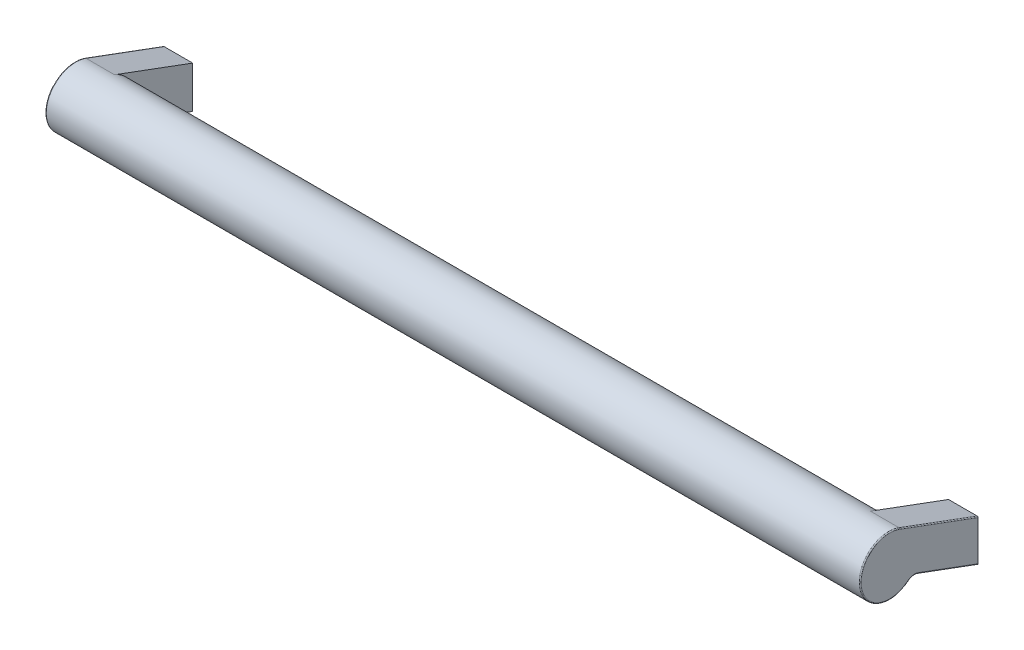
ISO-10303-21;
HEADER;
FILE_DESCRIPTION(('STEP AP214'),'2;1');
FILE_NAME('part.step','',(''),(''),'','','');
FILE_SCHEMA(('AUTOMOTIVE_DESIGN { 1 0 10303 214 1 1 1 1 }'));
ENDSEC;
DATA;
#1=APPLICATION_CONTEXT('core data for automotive mechanical design processes');
#2=APPLICATION_PROTOCOL_DEFINITION('international standard','automotive_design',2000,#1);
#3=PRODUCT_CONTEXT('',#1,'mechanical');
#4=PRODUCT('Part','Part','',(#3));
#5=PRODUCT_RELATED_PRODUCT_CATEGORY('part','',(#4));
#6=PRODUCT_DEFINITION_FORMATION('','',#4);
#7=PRODUCT_DEFINITION_CONTEXT('part definition',#1,'design');
#8=PRODUCT_DEFINITION('design','',#6,#7);
#9=PRODUCT_DEFINITION_SHAPE('','',#8);
#10=(LENGTH_UNIT() NAMED_UNIT(*) SI_UNIT(.MILLI.,.METRE.));
#11=(NAMED_UNIT(*) PLANE_ANGLE_UNIT() SI_UNIT($,.RADIAN.));
#12=(NAMED_UNIT(*) SI_UNIT($,.STERADIAN.) SOLID_ANGLE_UNIT());
#13=UNCERTAINTY_MEASURE_WITH_UNIT(LENGTH_MEASURE(1.E-05),#10,'distance_accuracy_value','');
#14=(GEOMETRIC_REPRESENTATION_CONTEXT(3) GLOBAL_UNCERTAINTY_ASSIGNED_CONTEXT((#13)) GLOBAL_UNIT_ASSIGNED_CONTEXT((#10,
#11,#12)) REPRESENTATION_CONTEXT('',''));
#15=CARTESIAN_POINT('',(0.,0.,0.));
#16=DIRECTION('',(0.,0.,1.));
#17=DIRECTION('',(1.,0.,0.));
#18=AXIS2_PLACEMENT_3D('',#15,#16,#17);
#19=CARTESIAN_POINT('',(142.5,11.,45.));
#20=DIRECTION('',(1.,0.,0.));
#21=DIRECTION('',(0.,1.,0.));
#22=AXIS2_PLACEMENT_3D('',#19,#20,#21);
#23=CYLINDRICAL_SURFACE('',#22,15.);
#24=CARTESIAN_POINT('',(7.5,11.,45.));
#25=DIRECTION('',(1.,0.,0.));
#26=DIRECTION('',(0.,1.,0.));
#27=AXIS2_PLACEMENT_3D('',#24,#25,#26);
#28=CIRCLE('',#27,15.);
#29=CARTESIAN_POINT('',(7.5,-0.545116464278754,35.4234512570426));
#30=VERTEX_POINT('',#29);
#31=CARTESIAN_POINT('',(7.5,25.0660927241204,39.7899102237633));
#32=VERTEX_POINT('',#31);
#33=EDGE_CURVE('E9',#30,#32,#28,.T.);
#34=ORIENTED_EDGE('',*,*,#33,.T.);
#35=DIRECTION('',(1.,0.,0.));
#36=VECTOR('',#35,1.);
#37=CARTESIAN_POINT('',(-7.5,25.0660927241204,39.7899102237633));
#38=LINE('',#37,#36);
#39=CARTESIAN_POINT('',(-7.,25.0660927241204,39.7899102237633));
#40=VERTEX_POINT('',#39);
#41=EDGE_CURVE('E373',#32,#40,#38,.F.);
#42=ORIENTED_EDGE('',*,*,#41,.T.);
#43=CARTESIAN_POINT('',(-7.,11.,45.));
#44=DIRECTION('',(1.,0.,0.));
#45=DIRECTION('',(0.,1.,0.));
#46=AXIS2_PLACEMENT_3D('',#43,#44,#45);
#47=CIRCLE('',#46,15.);
#48=CARTESIAN_POINT('',(-7.,-0.545116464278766,35.4234512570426));
#49=VERTEX_POINT('',#48);
#50=EDGE_CURVE('E354',#49,#40,#47,.F.);
#51=ORIENTED_EDGE('',*,*,#50,.F.);
#52=DIRECTION('',(1.,0.,0.));
#53=VECTOR('',#52,1.);
#54=CARTESIAN_POINT('',(-7.5,-0.545116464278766,35.4234512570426));
#55=LINE('',#54,#53);
#56=EDGE_CURVE('E372',#49,#30,#55,.T.);
#57=ORIENTED_EDGE('',*,*,#56,.T.);
#58=EDGE_LOOP('',(#34,#42,#51,#57));
#59=FACE_BOUND('',#58,.T.);
#60=DIRECTION('',(1.,0.,0.));
#61=VECTOR('',#60,1.);
#62=CARTESIAN_POINT('',(392.5,-0.545116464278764,35.4234512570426));
#63=LINE('',#62,#61);
#64=CARTESIAN_POINT('',(392.5,-0.545116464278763,35.4234512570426));
#65=VERTEX_POINT('',#64);
#66=CARTESIAN_POINT('',(407.,-0.545116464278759,35.4234512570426));
#67=VERTEX_POINT('',#66);
#68=EDGE_CURVE('E139',#65,#67,#63,.T.);
#69=ORIENTED_EDGE('',*,*,#68,.T.);
#70=CARTESIAN_POINT('',(407.,11.,45.));
#71=DIRECTION('',(1.,0.,0.));
#72=DIRECTION('',(0.,1.,0.));
#73=AXIS2_PLACEMENT_3D('',#70,#71,#72);
#74=CIRCLE('',#73,15.);
#75=CARTESIAN_POINT('',(407.,25.0660927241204,39.7899102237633));
#76=VERTEX_POINT('',#75);
#77=EDGE_CURVE('E166',#76,#67,#74,.T.);
#78=ORIENTED_EDGE('',*,*,#77,.F.);
#79=DIRECTION('',(1.,0.,0.));
#80=VECTOR('',#79,1.);
#81=CARTESIAN_POINT('',(392.5,25.0660927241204,39.7899102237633));
#82=LINE('',#81,#80);
#83=CARTESIAN_POINT('',(392.5,25.0660927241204,39.7899102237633));
#84=VERTEX_POINT('',#83);
#85=EDGE_CURVE('E142',#76,#84,#82,.F.);
#86=ORIENTED_EDGE('',*,*,#85,.T.);
#87=CARTESIAN_POINT('',(392.5,11.,45.));
#88=DIRECTION('',(1.,0.,0.));
#89=DIRECTION('',(0.,1.,0.));
#90=AXIS2_PLACEMENT_3D('',#87,#88,#89);
#91=CIRCLE('',#90,15.);
#92=EDGE_CURVE('E136',#65,#84,#91,.T.);
#93=ORIENTED_EDGE('',*,*,#92,.F.);
#94=EDGE_LOOP('',(#69,#78,#86,#93));
#95=FACE_BOUND('',#94,.T.);
#96=ADVANCED_FACE('F14',(#59,#95),#23,.T.);
#97=CARTESIAN_POINT('',(0.,0.,9.));
#98=DIRECTION('',(0.,0.,-1.));
#99=DIRECTION('',(1.,0.,0.));
#100=AXIS2_PLACEMENT_3D('',#97,#98,#99);
#101=PLANE('',#100);
#102=CARTESIAN_POINT('',(0.,0.,9.));
#103=DIRECTION('',(0.,0.,-1.));
#104=DIRECTION('',(1.,0.,0.));
#105=AXIS2_PLACEMENT_3D('',#102,#103,#104);
#106=CIRCLE('',#105,3.);
#107=CARTESIAN_POINT('',(3.,0.,9.));
#108=VERTEX_POINT('',#107);
#109=EDGE_CURVE('E208',#108,#108,#106,.T.);
#110=ORIENTED_EDGE('',*,*,#109,.T.);
#111=EDGE_LOOP('',(#110));
#112=FACE_BOUND('',#111,.T.);
#113=ADVANCED_FACE('F431',(#112),#101,.T.);
#114=CARTESIAN_POINT('',(-7.5,-4.39348861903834,32.2312683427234));
#115=DIRECTION('',(1.,0.,0.));
#116=DIRECTION('',(0.,1.,0.));
#117=AXIS2_PLACEMENT_3D('',#114,#115,#116);
#118=PLANE('',#117);
#119=CARTESIAN_POINT('',(-7.5,11.,45.));
#120=DIRECTION('',(1.,0.,0.));
#121=DIRECTION('',(0.,1.,0.));
#122=AXIS2_PLACEMENT_3D('',#119,#120,#121);
#123=CIRCLE('',#122,14.5);
#124=CARTESIAN_POINT('',(-7.5,25.5,45.));
#125=VERTEX_POINT('',#124);
#126=CARTESIAN_POINT('',(-7.5,-3.5,45.));
#127=VERTEX_POINT('',#126);
#128=EDGE_CURVE('E314',#125,#127,#123,.T.);
#129=ORIENTED_EDGE('',*,*,#128,.F.);
#130=CARTESIAN_POINT('',(-7.5,11.,45.));
#131=DIRECTION('',(1.,0.,0.));
#132=DIRECTION('',(0.,0.937739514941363,-0.347339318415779));
#133=AXIS2_PLACEMENT_3D('',#130,#131,#132);
#134=CIRCLE('',#133,14.5);
#135=CARTESIAN_POINT('',(-7.5,24.5972229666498,39.9635798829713));
#136=VERTEX_POINT('',#135);
#137=EDGE_CURVE('E302',#136,#125,#134,.T.);
#138=ORIENTED_EDGE('',*,*,#137,.F.);
#139=DIRECTION('',(0.,0.347339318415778,0.937739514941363));
#140=VECTOR('',#139,1.);
#141=CARTESIAN_POINT('',(-7.5,9.79468731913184,0.));
#142=LINE('',#141,#140);
#143=CARTESIAN_POINT('',(-7.5,9.79468731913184,0.));
#144=VERTEX_POINT('',#143);
#145=EDGE_CURVE('E328',#144,#136,#142,.T.);
#146=ORIENTED_EDGE('',*,*,#145,.F.);
#147=DIRECTION('',(0.,1.,0.));
#148=VECTOR('',#147,1.);
#149=CARTESIAN_POINT('',(-7.5,-4.39348861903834,0.));
#150=LINE('',#149,#148);
#151=CARTESIAN_POINT('',(-7.5,-10.466802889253,0.));
#152=VERTEX_POINT('',#151);
#153=EDGE_CURVE('E335',#152,#144,#150,.T.);
#154=ORIENTED_EDGE('',*,*,#153,.F.);
#155=DIRECTION('',(0.,-0.347339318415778,-0.937739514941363));
#156=VECTOR('',#155,1.);
#157=CARTESIAN_POINT('',(-7.5,0.764078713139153,30.3209020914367));
#158=LINE('',#157,#156);
#159=CARTESIAN_POINT('',(-7.5,0.764078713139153,30.3209020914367));
#160=VERTEX_POINT('',#159);
#161=EDGE_CURVE('E338',#160,#152,#158,.T.);
#162=ORIENTED_EDGE('',*,*,#161,.F.);
#163=CARTESIAN_POINT('',(-7.5,-4.39348861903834,32.2312683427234));
#164=DIRECTION('',(-1.,0.,0.));
#165=DIRECTION('',(0.,1.,0.));
#166=AXIS2_PLACEMENT_3D('',#163,#164,#165);
#167=CIRCLE('',#166,5.5);
#168=CARTESIAN_POINT('',(-7.5,1.10651138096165,32.2312683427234));
#169=VERTEX_POINT('',#168);
#170=EDGE_CURVE('E290',#169,#160,#167,.T.);
#171=ORIENTED_EDGE('',*,*,#170,.F.);
#172=CARTESIAN_POINT('',(-7.5,-4.39348861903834,32.2312683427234));
#173=DIRECTION('',(-1.,0.,0.));
#174=DIRECTION('',(0.,0.769674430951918,0.638436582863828));
#175=AXIS2_PLACEMENT_3D('',#172,#173,#174);
#176=CIRCLE('',#175,5.5);
#177=CARTESIAN_POINT('',(-7.5,-0.160279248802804,35.7426695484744));
#178=VERTEX_POINT('',#177);
#179=EDGE_CURVE('E249',#178,#169,#176,.T.);
#180=ORIENTED_EDGE('',*,*,#179,.F.);
#181=CARTESIAN_POINT('',(-7.5,11.,45.));
#182=DIRECTION('',(1.,0.,0.));
#183=DIRECTION('',(0.,-1.,0.));
#184=AXIS2_PLACEMENT_3D('',#181,#182,#183);
#185=CIRCLE('',#184,14.5);
#186=EDGE_CURVE('E21',#127,#178,#185,.T.);
#187=ORIENTED_EDGE('',*,*,#186,.F.);
#188=EDGE_LOOP('',(#129,#138,#146,#154,#162,#171,#180,#187));
#189=FACE_BOUND('',#188,.T.);
#190=ADVANCED_FACE('F268',(#189),#118,.F.);
#191=CARTESIAN_POINT('',(0.,0.,9.));
#192=DIRECTION('',(0.,0.,-1.));
#193=DIRECTION('',(1.,0.,0.));
#194=AXIS2_PLACEMENT_3D('',#191,#192,#193);
#195=CYLINDRICAL_SURFACE('',#194,3.);
#196=ORIENTED_EDGE('',*,*,#109,.F.);
#197=EDGE_LOOP('',(#196));
#198=FACE_BOUND('',#197,.T.);
#199=CARTESIAN_POINT('',(0.,0.,0.));
#200=DIRECTION('',(0.,0.,-1.));
#201=DIRECTION('',(1.,0.,0.));
#202=AXIS2_PLACEMENT_3D('',#199,#200,#201);
#203=CIRCLE('',#202,3.);
#204=CARTESIAN_POINT('',(3.,0.,0.));
#205=VERTEX_POINT('',#204);
#206=EDGE_CURVE('E205',#205,#205,#203,.T.);
#207=ORIENTED_EDGE('',*,*,#206,.T.);
#208=EDGE_LOOP('',(#207));
#209=FACE_BOUND('',#208,.T.);
#210=ADVANCED_FACE('F435',(#198,#209),#195,.F.);
#211=CARTESIAN_POINT('',(-7.,0.764078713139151,30.3209020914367));
#212=DIRECTION('',(0.,0.347339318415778,0.937739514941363));
#213=DIRECTION('',(0.,0.937739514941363,-0.347339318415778));
#214=AXIS2_PLACEMENT_3D('',#211,#212,#213);
#215=CYLINDRICAL_SURFACE('',#214,0.5);
#216=CARTESIAN_POINT('',(-7.,0.764078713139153,30.3209020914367));
#217=DIRECTION('',(0.,0.347339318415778,0.937739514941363));
#218=DIRECTION('',(0.,0.937739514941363,-0.347339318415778));
#219=AXIS2_PLACEMENT_3D('',#216,#217,#218);
#220=CIRCLE('',#219,0.5);
#221=CARTESIAN_POINT('',(-7.,0.29520895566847,30.4945717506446));
#222=VERTEX_POINT('',#221);
#223=EDGE_CURVE('E364',#222,#160,#220,.F.);
#224=ORIENTED_EDGE('',*,*,#223,.T.);
#225=ORIENTED_EDGE('',*,*,#161,.T.);
#226=CARTESIAN_POINT('',(-7.,-10.466802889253,0.));
#227=DIRECTION('',(0.,0.,1.));
#228=DIRECTION('',(0.,1.,0.));
#229=AXIS2_PLACEMENT_3D('',#226,#227,#228);
#230=ELLIPSE('',#229,0.53319711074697,0.5);
#231=CARTESIAN_POINT('',(-7.,-11.,0.));
#232=VERTEX_POINT('',#231);
#233=EDGE_CURVE('E366',#152,#232,#230,.T.);
#234=ORIENTED_EDGE('',*,*,#233,.T.);
#235=DIRECTION('',(0.,0.347339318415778,0.937739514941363));
#236=VECTOR('',#235,1.);
#237=CARTESIAN_POINT('',(-7.,0.295208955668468,30.4945717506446));
#238=LINE('',#237,#236);
#239=EDGE_CURVE('E217',#232,#222,#238,.T.);
#240=ORIENTED_EDGE('',*,*,#239,.T.);
#241=EDGE_LOOP('',(#224,#225,#234,#240));
#242=FACE_BOUND('',#241,.T.);
#243=ADVANCED_FACE('F226',(#242),#215,.T.);
#244=CARTESIAN_POINT('',(-7.,-4.39348861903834,32.2312683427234));
#245=DIRECTION('',(1.,0.,0.));
#246=DIRECTION('',(0.,1.,0.));
#247=AXIS2_PLACEMENT_3D('',#244,#245,#246);
#248=TOROIDAL_SURFACE('',#247,5.49999999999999,0.5);
#249=ORIENTED_EDGE('',*,*,#170,.T.);
#250=ORIENTED_EDGE('',*,*,#223,.F.);
#251=CARTESIAN_POINT('',(-7.,-4.39348861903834,32.2312683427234));
#252=DIRECTION('',(1.,0.,0.));
#253=DIRECTION('',(0.,1.,0.));
#254=AXIS2_PLACEMENT_3D('',#251,#252,#253);
#255=CIRCLE('',#254,5.);
#256=EDGE_CURVE('E382',#222,#49,#255,.T.);
#257=ORIENTED_EDGE('',*,*,#256,.T.);
#258=CARTESIAN_POINT('',(-7.,-0.160279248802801,35.7426695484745));
#259=DIRECTION('',(0.,0.638436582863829,-0.769674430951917));
#260=DIRECTION('',(0.,-0.769674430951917,-0.638436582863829));
#261=AXIS2_PLACEMENT_3D('',#258,#259,#260);
#262=CIRCLE('',#261,0.5);
#263=EDGE_CURVE('E347',#178,#49,#262,.F.);
#264=ORIENTED_EDGE('',*,*,#263,.F.);
#265=ORIENTED_EDGE('',*,*,#179,.T.);
#266=EDGE_LOOP('',(#249,#250,#257,#264,#265));
#267=FACE_BOUND('',#266,.T.);
#268=ADVANCED_FACE('F220',(#267),#248,.T.);
#269=CARTESIAN_POINT('',(-7.,18.5811294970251,23.7214550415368));
#270=DIRECTION('',(0.,-0.347339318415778,-0.937739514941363));
#271=DIRECTION('',(0.,-0.937739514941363,0.347339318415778));
#272=AXIS2_PLACEMENT_3D('',#269,#270,#271);
#273=CYLINDRICAL_SURFACE('',#272,0.5);
#274=CARTESIAN_POINT('',(-7.,9.79468731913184,0.));
#275=DIRECTION('',(0.,0.,1.));
#276=DIRECTION('',(0.,-1.,0.));
#277=AXIS2_PLACEMENT_3D('',#274,#275,#276);
#278=ELLIPSE('',#277,0.533197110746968,0.5);
#279=CARTESIAN_POINT('',(-7.,10.3278844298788,0.));
#280=VERTEX_POINT('',#279);
#281=EDGE_CURVE('E359',#280,#144,#278,.T.);
#282=ORIENTED_EDGE('',*,*,#281,.T.);
#283=ORIENTED_EDGE('',*,*,#145,.T.);
#284=CARTESIAN_POINT('',(-7.,24.5972229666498,39.9635798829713));
#285=DIRECTION('',(0.,0.347339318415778,0.937739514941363));
#286=DIRECTION('',(0.,0.937739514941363,-0.347339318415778));
#287=AXIS2_PLACEMENT_3D('',#284,#285,#286);
#288=CIRCLE('',#287,0.5);
#289=EDGE_CURVE('E355',#40,#136,#288,.T.);
#290=ORIENTED_EDGE('',*,*,#289,.F.);
#291=DIRECTION('',(0.,-0.347339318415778,-0.937739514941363));
#292=VECTOR('',#291,1.);
#293=CARTESIAN_POINT('',(-7.,19.0499992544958,23.547785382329));
#294=LINE('',#293,#292);
#295=EDGE_CURVE('E276',#40,#280,#294,.T.);
#296=ORIENTED_EDGE('',*,*,#295,.T.);
#297=EDGE_LOOP('',(#282,#283,#290,#296));
#298=FACE_BOUND('',#297,.T.);
#299=ADVANCED_FACE('F225',(#298),#273,.T.);
#300=CARTESIAN_POINT('',(-7.,11.,45.));
#301=DIRECTION('',(1.,0.,0.));
#302=DIRECTION('',(0.,1.,0.));
#303=AXIS2_PLACEMENT_3D('',#300,#301,#302);
#304=TOROIDAL_SURFACE('',#303,14.5,0.5);
#305=ORIENTED_EDGE('',*,*,#263,.T.);
#306=ORIENTED_EDGE('',*,*,#50,.T.);
#307=ORIENTED_EDGE('',*,*,#289,.T.);
#308=ORIENTED_EDGE('',*,*,#137,.T.);
#309=ORIENTED_EDGE('',*,*,#128,.T.);
#310=ORIENTED_EDGE('',*,*,#186,.T.);
#311=EDGE_LOOP('',(#305,#306,#307,#308,#309,#310));
#312=FACE_BOUND('',#311,.T.);
#313=ADVANCED_FACE('F256',(#312),#304,.T.);
#314=CARTESIAN_POINT('',(-7.5,10.3278844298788,0.));
#315=DIRECTION('',(0.,0.,1.));
#316=DIRECTION('',(-1.,0.,0.));
#317=AXIS2_PLACEMENT_3D('',#314,#315,#316);
#318=PLANE('',#317);
#319=ORIENTED_EDGE('',*,*,#206,.F.);
#320=EDGE_LOOP('',(#319));
#321=FACE_BOUND('',#320,.T.);
#322=ORIENTED_EDGE('',*,*,#281,.F.);
#323=DIRECTION('',(-1.,0.,0.));
#324=VECTOR('',#323,1.);
#325=CARTESIAN_POINT('',(-7.5,10.3278844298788,0.));
#326=LINE('',#325,#324);
#327=CARTESIAN_POINT('',(7.5,10.3278844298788,0.));
#328=VERTEX_POINT('',#327);
#329=EDGE_CURVE('E380',#328,#280,#326,.T.);
#330=ORIENTED_EDGE('',*,*,#329,.F.);
#331=DIRECTION('',(0.,-1.,0.));
#332=VECTOR('',#331,1.);
#333=CARTESIAN_POINT('',(7.5,10.3278844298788,0.));
#334=LINE('',#333,#332);
#335=CARTESIAN_POINT('',(7.5,-11.,0.));
#336=VERTEX_POINT('',#335);
#337=EDGE_CURVE('E377',#336,#328,#334,.F.);
#338=ORIENTED_EDGE('',*,*,#337,.F.);
#339=DIRECTION('',(-1.,0.,0.));
#340=VECTOR('',#339,1.);
#341=CARTESIAN_POINT('',(-7.5,-11.,0.));
#342=LINE('',#341,#340);
#343=EDGE_CURVE('E381',#232,#336,#342,.F.);
#344=ORIENTED_EDGE('',*,*,#343,.F.);
#345=ORIENTED_EDGE('',*,*,#233,.F.);
#346=ORIENTED_EDGE('',*,*,#153,.T.);
#347=EDGE_LOOP('',(#322,#330,#338,#344,#345,#346));
#348=FACE_BOUND('',#347,.T.);
#349=ADVANCED_FACE('F266',(#321,#348),#318,.F.);
#350=CARTESIAN_POINT('',(-7.5,-11.,0.));
#351=DIRECTION('',(0.,0.937739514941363,-0.347339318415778));
#352=DIRECTION('',(0.,-0.347339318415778,-0.937739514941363));
#353=AXIS2_PLACEMENT_3D('',#350,#351,#352);
#354=PLANE('',#353);
#355=ORIENTED_EDGE('',*,*,#239,.F.);
#356=ORIENTED_EDGE('',*,*,#343,.T.);
#357=DIRECTION('',(0.,-0.347339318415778,-0.937739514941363));
#358=VECTOR('',#357,1.);
#359=CARTESIAN_POINT('',(7.5,0.29520895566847,30.4945717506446));
#360=LINE('',#359,#358);
#361=CARTESIAN_POINT('',(7.5,0.29520895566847,30.4945717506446));
#362=VERTEX_POINT('',#361);
#363=EDGE_CURVE('E212',#362,#336,#360,.T.);
#364=ORIENTED_EDGE('',*,*,#363,.F.);
#365=DIRECTION('',(-1.,0.,0.));
#366=VECTOR('',#365,1.);
#367=CARTESIAN_POINT('',(-7.5,0.29520895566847,30.4945717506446));
#368=LINE('',#367,#366);
#369=EDGE_CURVE('E211',#222,#362,#368,.F.);
#370=ORIENTED_EDGE('',*,*,#369,.F.);
#371=EDGE_LOOP('',(#355,#356,#364,#370));
#372=FACE_BOUND('',#371,.T.);
#373=ADVANCED_FACE('F417',(#372),#354,.F.);
#374=CARTESIAN_POINT('',(-7.5,-4.39348861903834,32.2312683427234));
#375=DIRECTION('',(1.,0.,0.));
#376=DIRECTION('',(0.,1.,0.));
#377=AXIS2_PLACEMENT_3D('',#374,#375,#376);
#378=CYLINDRICAL_SURFACE('',#377,5.);
#379=ORIENTED_EDGE('',*,*,#256,.F.);
#380=ORIENTED_EDGE('',*,*,#369,.T.);
#381=CARTESIAN_POINT('',(7.5,-4.39348861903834,32.2312683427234));
#382=DIRECTION('',(1.,0.,0.));
#383=DIRECTION('',(0.,1.,0.));
#384=AXIS2_PLACEMENT_3D('',#381,#382,#383);
#385=CIRCLE('',#384,5.);
#386=EDGE_CURVE('E214',#30,#362,#385,.F.);
#387=ORIENTED_EDGE('',*,*,#386,.F.);
#388=ORIENTED_EDGE('',*,*,#56,.F.);
#389=EDGE_LOOP('',(#379,#380,#387,#388));
#390=FACE_BOUND('',#389,.T.);
#391=ADVANCED_FACE('F414',(#390),#378,.F.);
#392=CARTESIAN_POINT('',(-7.5,10.3278844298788,0.));
#393=DIRECTION('',(0.,-0.937739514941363,0.347339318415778));
#394=DIRECTION('',(0.,0.347339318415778,0.937739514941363));
#395=AXIS2_PLACEMENT_3D('',#392,#393,#394);
#396=PLANE('',#395);
#397=ORIENTED_EDGE('',*,*,#295,.F.);
#398=ORIENTED_EDGE('',*,*,#41,.F.);
#399=DIRECTION('',(0.,0.347339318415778,0.937739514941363));
#400=VECTOR('',#399,1.);
#401=CARTESIAN_POINT('',(7.5,10.3278844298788,0.));
#402=LINE('',#401,#400);
#403=EDGE_CURVE('E375',#328,#32,#402,.T.);
#404=ORIENTED_EDGE('',*,*,#403,.F.);
#405=ORIENTED_EDGE('',*,*,#329,.T.);
#406=EDGE_LOOP('',(#397,#398,#404,#405));
#407=FACE_BOUND('',#406,.T.);
#408=ADVANCED_FACE('F228',(#407),#396,.F.);
#409=CARTESIAN_POINT('',(7.5,-4.39348861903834,32.2312683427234));
#410=DIRECTION('',(1.,0.,0.));
#411=DIRECTION('',(0.,1.,0.));
#412=AXIS2_PLACEMENT_3D('',#409,#410,#411);
#413=PLANE('',#412);
#414=ORIENTED_EDGE('',*,*,#403,.T.);
#415=ORIENTED_EDGE('',*,*,#33,.F.);
#416=ORIENTED_EDGE('',*,*,#386,.T.);
#417=ORIENTED_EDGE('',*,*,#363,.T.);
#418=ORIENTED_EDGE('',*,*,#337,.T.);
#419=EDGE_LOOP('',(#414,#415,#416,#417,#418));
#420=FACE_BOUND('',#419,.T.);
#421=ADVANCED_FACE('F418',(#420),#413,.T.);
#422=CARTESIAN_POINT('',(400.,0.,9.));
#423=DIRECTION('',(0.,0.,-1.));
#424=DIRECTION('',(1.,0.,0.));
#425=AXIS2_PLACEMENT_3D('',#422,#423,#424);
#426=PLANE('',#425);
#427=CARTESIAN_POINT('',(400.,0.,9.));
#428=DIRECTION('',(0.,0.,-1.));
#429=DIRECTION('',(1.,0.,0.));
#430=AXIS2_PLACEMENT_3D('',#427,#428,#429);
#431=CIRCLE('',#430,3.);
#432=CARTESIAN_POINT('',(403.,0.,9.));
#433=VERTEX_POINT('',#432);
#434=EDGE_CURVE('E154',#433,#433,#431,.T.);
#435=ORIENTED_EDGE('',*,*,#434,.T.);
#436=EDGE_LOOP('',(#435));
#437=FACE_BOUND('',#436,.T.);
#438=ADVANCED_FACE('F420',(#437),#426,.T.);
#439=CARTESIAN_POINT('',(400.,0.,9.));
#440=DIRECTION('',(0.,0.,-1.));
#441=DIRECTION('',(1.,0.,0.));
#442=AXIS2_PLACEMENT_3D('',#439,#440,#441);
#443=CYLINDRICAL_SURFACE('',#442,3.);
#444=ORIENTED_EDGE('',*,*,#434,.F.);
#445=EDGE_LOOP('',(#444));
#446=FACE_BOUND('',#445,.T.);
#447=CARTESIAN_POINT('',(400.,0.,0.));
#448=DIRECTION('',(0.,0.,-1.));
#449=DIRECTION('',(1.,0.,0.));
#450=AXIS2_PLACEMENT_3D('',#447,#448,#449);
#451=CIRCLE('',#450,3.);
#452=CARTESIAN_POINT('',(403.,0.,0.));
#453=VERTEX_POINT('',#452);
#454=EDGE_CURVE('E202',#453,#453,#451,.T.);
#455=ORIENTED_EDGE('',*,*,#454,.T.);
#456=EDGE_LOOP('',(#455));
#457=FACE_BOUND('',#456,.T.);
#458=ADVANCED_FACE('F426',(#446,#457),#443,.F.);
#459=CARTESIAN_POINT('',(407.,-10.5311302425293,-0.173669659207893));
#460=DIRECTION('',(0.,-0.347339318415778,-0.937739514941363));
#461=DIRECTION('',(0.,-0.937739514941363,0.347339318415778));
#462=AXIS2_PLACEMENT_3D('',#459,#460,#461);
#463=CYLINDRICAL_SURFACE('',#462,0.5);
#464=CARTESIAN_POINT('',(407.,0.764078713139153,30.3209020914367));
#465=DIRECTION('',(0.,-0.347339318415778,-0.937739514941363));
#466=DIRECTION('',(0.,-0.937739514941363,0.347339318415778));
#467=AXIS2_PLACEMENT_3D('',#464,#465,#466);
#468=CIRCLE('',#467,0.5);
#469=CARTESIAN_POINT('',(407.5,0.764078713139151,30.3209020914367));
#470=VERTEX_POINT('',#469);
#471=CARTESIAN_POINT('',(407.,0.29520895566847,30.4945717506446));
#472=VERTEX_POINT('',#471);
#473=EDGE_CURVE('E162',#470,#472,#468,.T.);
#474=ORIENTED_EDGE('',*,*,#473,.T.);
#475=DIRECTION('',(0.,-0.347339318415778,-0.937739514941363));
#476=VECTOR('',#475,1.);
#477=CARTESIAN_POINT('',(407.,-11.,0.));
#478=LINE('',#477,#476);
#479=CARTESIAN_POINT('',(407.,-11.,0.));
#480=VERTEX_POINT('',#479);
#481=EDGE_CURVE('E198',#472,#480,#478,.T.);
#482=ORIENTED_EDGE('',*,*,#481,.T.);
#483=CARTESIAN_POINT('',(407.,-10.466802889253,0.));
#484=DIRECTION('',(0.,0.,1.));
#485=DIRECTION('',(0.,-1.,0.));
#486=AXIS2_PLACEMENT_3D('',#483,#484,#485);
#487=ELLIPSE('',#486,0.53319711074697,0.5);
#488=CARTESIAN_POINT('',(407.5,-10.466802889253,0.));
#489=VERTEX_POINT('',#488);
#490=EDGE_CURVE('E594',#480,#489,#487,.T.);
#491=ORIENTED_EDGE('',*,*,#490,.T.);
#492=DIRECTION('',(0.,-0.347339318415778,-0.937739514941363));
#493=VECTOR('',#492,1.);
#494=CARTESIAN_POINT('',(407.5,0.764078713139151,30.3209020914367));
#495=LINE('',#494,#493);
#496=EDGE_CURVE('E617',#470,#489,#495,.T.);
#497=ORIENTED_EDGE('',*,*,#496,.F.);
#498=EDGE_LOOP('',(#474,#482,#491,#497));
#499=FACE_BOUND('',#498,.T.);
#500=ADVANCED_FACE('F190',(#499),#463,.T.);
#501=CARTESIAN_POINT('',(392.5,10.3278844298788,0.));
#502=DIRECTION('',(0.,0.,1.));
#503=DIRECTION('',(-1.,0.,0.));
#504=AXIS2_PLACEMENT_3D('',#501,#502,#503);
#505=PLANE('',#504);
#506=ORIENTED_EDGE('',*,*,#454,.F.);
#507=EDGE_LOOP('',(#506));
#508=FACE_BOUND('',#507,.T.);
#509=ORIENTED_EDGE('',*,*,#490,.F.);
#510=DIRECTION('',(-1.,0.,0.));
#511=VECTOR('',#510,1.);
#512=CARTESIAN_POINT('',(392.5,-11.,0.));
#513=LINE('',#512,#511);
#514=CARTESIAN_POINT('',(392.5,-11.,0.));
#515=VERTEX_POINT('',#514);
#516=EDGE_CURVE('E593',#515,#480,#513,.F.);
#517=ORIENTED_EDGE('',*,*,#516,.F.);
#518=DIRECTION('',(0.,-1.,0.));
#519=VECTOR('',#518,1.);
#520=CARTESIAN_POINT('',(392.5,10.3278844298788,0.));
#521=LINE('',#520,#519);
#522=CARTESIAN_POINT('',(392.5,10.3278844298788,0.));
#523=VERTEX_POINT('',#522);
#524=EDGE_CURVE('E592',#523,#515,#521,.T.);
#525=ORIENTED_EDGE('',*,*,#524,.F.);
#526=DIRECTION('',(-1.,0.,0.));
#527=VECTOR('',#526,1.);
#528=CARTESIAN_POINT('',(392.5,10.3278844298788,0.));
#529=LINE('',#528,#527);
#530=CARTESIAN_POINT('',(407.,10.3278844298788,0.));
#531=VERTEX_POINT('',#530);
#532=EDGE_CURVE('E590',#531,#523,#529,.T.);
#533=ORIENTED_EDGE('',*,*,#532,.F.);
#534=CARTESIAN_POINT('',(407.,9.79468731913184,0.));
#535=DIRECTION('',(0.,0.,1.));
#536=DIRECTION('',(0.,1.,0.));
#537=AXIS2_PLACEMENT_3D('',#534,#535,#536);
#538=ELLIPSE('',#537,0.533197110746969,0.5);
#539=CARTESIAN_POINT('',(407.5,9.79468731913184,0.));
#540=VERTEX_POINT('',#539);
#541=EDGE_CURVE('E589',#540,#531,#538,.T.);
#542=ORIENTED_EDGE('',*,*,#541,.F.);
#543=DIRECTION('',(0.,1.,0.));
#544=VECTOR('',#543,1.);
#545=CARTESIAN_POINT('',(407.5,-4.39348861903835,0.));
#546=LINE('',#545,#544);
#547=EDGE_CURVE('E613',#489,#540,#546,.T.);
#548=ORIENTED_EDGE('',*,*,#547,.F.);
#549=EDGE_LOOP('',(#509,#517,#525,#533,#542,#548));
#550=FACE_BOUND('',#549,.T.);
#551=ADVANCED_FACE('F495',(#508,#550),#505,.F.);
#552=CARTESIAN_POINT('',(407.,9.85901467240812,0.173669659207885));
#553=DIRECTION('',(0.,0.347339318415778,0.937739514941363));
#554=DIRECTION('',(0.,0.937739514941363,-0.347339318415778));
#555=AXIS2_PLACEMENT_3D('',#552,#553,#554);
#556=CYLINDRICAL_SURFACE('',#555,0.5);
#557=CARTESIAN_POINT('',(407.,24.5972229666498,39.9635798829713));
#558=DIRECTION('',(0.,0.347339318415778,0.937739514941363));
#559=DIRECTION('',(0.,0.937739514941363,-0.347339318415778));
#560=AXIS2_PLACEMENT_3D('',#557,#558,#559);
#561=CIRCLE('',#560,0.5);
#562=CARTESIAN_POINT('',(407.5,24.5972229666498,39.9635798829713));
#563=VERTEX_POINT('',#562);
#564=EDGE_CURVE('E169',#563,#76,#561,.T.);
#565=ORIENTED_EDGE('',*,*,#564,.F.);
#566=DIRECTION('',(0.,0.347339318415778,0.937739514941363));
#567=VECTOR('',#566,1.);
#568=CARTESIAN_POINT('',(407.5,9.79468731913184,0.));
#569=LINE('',#568,#567);
#570=EDGE_CURVE('E618',#540,#563,#569,.T.);
#571=ORIENTED_EDGE('',*,*,#570,.F.);
#572=ORIENTED_EDGE('',*,*,#541,.T.);
#573=DIRECTION('',(0.,0.347339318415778,0.937739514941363));
#574=VECTOR('',#573,1.);
#575=CARTESIAN_POINT('',(407.,10.3278844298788,0.));
#576=LINE('',#575,#574);
#577=EDGE_CURVE('E586',#531,#76,#576,.T.);
#578=ORIENTED_EDGE('',*,*,#577,.T.);
#579=EDGE_LOOP('',(#565,#571,#572,#578));
#580=FACE_BOUND('',#579,.T.);
#581=ADVANCED_FACE('F504',(#580),#556,.T.);
#582=CARTESIAN_POINT('',(407.5,-4.39348861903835,32.2312683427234));
#583=DIRECTION('',(1.,0.,0.));
#584=DIRECTION('',(0.,1.,0.));
#585=AXIS2_PLACEMENT_3D('',#582,#583,#584);
#586=PLANE('',#585);
#587=CARTESIAN_POINT('',(407.5,11.,45.));
#588=DIRECTION('',(-1.,0.,0.));
#589=DIRECTION('',(0.,-1.,0.));
#590=AXIS2_PLACEMENT_3D('',#587,#588,#589);
#591=CIRCLE('',#590,14.5);
#592=CARTESIAN_POINT('',(407.5,25.5,45.));
#593=VERTEX_POINT('',#592);
#594=CARTESIAN_POINT('',(407.5,-3.5,45.));
#595=VERTEX_POINT('',#594);
#596=EDGE_CURVE('E655',#593,#595,#591,.F.);
#597=ORIENTED_EDGE('',*,*,#596,.T.);
#598=CARTESIAN_POINT('',(407.5,11.,45.));
#599=DIRECTION('',(-1.,0.,0.));
#600=DIRECTION('',(0.,-0.769674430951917,-0.638436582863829));
#601=AXIS2_PLACEMENT_3D('',#598,#599,#600);
#602=CIRCLE('',#601,14.5);
#603=CARTESIAN_POINT('',(407.5,-0.160279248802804,35.7426695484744));
#604=VERTEX_POINT('',#603);
#605=EDGE_CURVE('E145',#595,#604,#602,.F.);
#606=ORIENTED_EDGE('',*,*,#605,.T.);
#607=CARTESIAN_POINT('',(407.5,-4.39348861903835,32.2312683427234));
#608=DIRECTION('',(1.,0.,0.));
#609=DIRECTION('',(0.,1.,0.));
#610=AXIS2_PLACEMENT_3D('',#607,#608,#609);
#611=CIRCLE('',#610,5.5);
#612=CARTESIAN_POINT('',(407.5,1.10651138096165,32.2312683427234));
#613=VERTEX_POINT('',#612);
#614=EDGE_CURVE('E626',#604,#613,#611,.F.);
#615=ORIENTED_EDGE('',*,*,#614,.T.);
#616=CARTESIAN_POINT('',(407.5,-4.39348861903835,32.2312683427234));
#617=DIRECTION('',(1.,0.,0.));
#618=DIRECTION('',(0.,0.937739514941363,-0.347339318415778));
#619=AXIS2_PLACEMENT_3D('',#616,#617,#618);
#620=CIRCLE('',#619,5.5);
#621=EDGE_CURVE('E622',#613,#470,#620,.F.);
#622=ORIENTED_EDGE('',*,*,#621,.T.);
#623=ORIENTED_EDGE('',*,*,#496,.T.);
#624=ORIENTED_EDGE('',*,*,#547,.T.);
#625=ORIENTED_EDGE('',*,*,#570,.T.);
#626=CARTESIAN_POINT('',(407.5,11.,45.));
#627=DIRECTION('',(-1.,0.,0.));
#628=DIRECTION('',(0.,1.,0.));
#629=AXIS2_PLACEMENT_3D('',#626,#627,#628);
#630=CIRCLE('',#629,14.5);
#631=EDGE_CURVE('E634',#563,#593,#630,.F.);
#632=ORIENTED_EDGE('',*,*,#631,.T.);
#633=EDGE_LOOP('',(#597,#606,#615,#622,#623,#624,#625,#632));
#634=FACE_BOUND('',#633,.T.);
#635=ADVANCED_FACE('F188',(#634),#586,.T.);
#636=CARTESIAN_POINT('',(407.,-4.39348861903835,32.2312683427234));
#637=DIRECTION('',(1.,0.,0.));
#638=DIRECTION('',(0.,1.,0.));
#639=AXIS2_PLACEMENT_3D('',#636,#637,#638);
#640=TOROIDAL_SURFACE('',#639,5.5,0.5);
#641=CARTESIAN_POINT('',(407.,-4.39348861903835,32.2312683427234));
#642=DIRECTION('',(1.,0.,0.));
#643=DIRECTION('',(0.,1.,0.));
#644=AXIS2_PLACEMENT_3D('',#641,#642,#643);
#645=CIRCLE('',#644,5.);
#646=EDGE_CURVE('E158',#67,#472,#645,.F.);
#647=ORIENTED_EDGE('',*,*,#646,.T.);
#648=ORIENTED_EDGE('',*,*,#473,.F.);
#649=ORIENTED_EDGE('',*,*,#621,.F.);
#650=ORIENTED_EDGE('',*,*,#614,.F.);
#651=CARTESIAN_POINT('',(407.,-0.160279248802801,35.7426695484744));
#652=DIRECTION('',(0.,0.638436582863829,-0.769674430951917));
#653=DIRECTION('',(0.,-0.769674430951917,-0.638436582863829));
#654=AXIS2_PLACEMENT_3D('',#651,#652,#653);
#655=CIRCLE('',#654,0.5);
#656=EDGE_CURVE('E170',#67,#604,#655,.F.);
#657=ORIENTED_EDGE('',*,*,#656,.F.);
#658=EDGE_LOOP('',(#647,#648,#649,#650,#657));
#659=FACE_BOUND('',#658,.T.);
#660=ADVANCED_FACE('F176',(#659),#640,.T.);
#661=CARTESIAN_POINT('',(392.5,-11.,0.));
#662=DIRECTION('',(0.,0.937739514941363,-0.347339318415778));
#663=DIRECTION('',(0.,-0.347339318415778,-0.937739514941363));
#664=AXIS2_PLACEMENT_3D('',#661,#662,#663);
#665=PLANE('',#664);
#666=ORIENTED_EDGE('',*,*,#481,.F.);
#667=DIRECTION('',(-1.,0.,0.));
#668=VECTOR('',#667,1.);
#669=CARTESIAN_POINT('',(392.5,0.29520895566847,30.4945717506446));
#670=LINE('',#669,#668);
#671=CARTESIAN_POINT('',(392.5,0.29520895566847,30.4945717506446));
#672=VERTEX_POINT('',#671);
#673=EDGE_CURVE('E607',#672,#472,#670,.F.);
#674=ORIENTED_EDGE('',*,*,#673,.F.);
#675=DIRECTION('',(0.,-0.347339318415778,-0.937739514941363));
#676=VECTOR('',#675,1.);
#677=CARTESIAN_POINT('',(392.5,-11.,0.));
#678=LINE('',#677,#676);
#679=EDGE_CURVE('E151',#515,#672,#678,.F.);
#680=ORIENTED_EDGE('',*,*,#679,.F.);
#681=ORIENTED_EDGE('',*,*,#516,.T.);
#682=EDGE_LOOP('',(#666,#674,#680,#681));
#683=FACE_BOUND('',#682,.T.);
#684=ADVANCED_FACE('F187',(#683),#665,.F.);
#685=CARTESIAN_POINT('',(392.5,-4.39348861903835,32.2312683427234));
#686=DIRECTION('',(1.,0.,0.));
#687=DIRECTION('',(0.,1.,0.));
#688=AXIS2_PLACEMENT_3D('',#685,#686,#687);
#689=PLANE('',#688);
#690=CARTESIAN_POINT('',(392.5,-4.39348861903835,32.2312683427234));
#691=DIRECTION('',(1.,0.,0.));
#692=DIRECTION('',(0.,1.,0.));
#693=AXIS2_PLACEMENT_3D('',#690,#691,#692);
#694=CIRCLE('',#693,5.);
#695=EDGE_CURVE('E148',#65,#672,#694,.F.);
#696=ORIENTED_EDGE('',*,*,#695,.F.);
#697=ORIENTED_EDGE('',*,*,#92,.T.);
#698=DIRECTION('',(0.,0.347339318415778,0.937739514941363));
#699=VECTOR('',#698,1.);
#700=CARTESIAN_POINT('',(392.5,10.3278844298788,0.));
#701=LINE('',#700,#699);
#702=EDGE_CURVE('E160',#84,#523,#701,.F.);
#703=ORIENTED_EDGE('',*,*,#702,.T.);
#704=ORIENTED_EDGE('',*,*,#524,.T.);
#705=ORIENTED_EDGE('',*,*,#679,.T.);
#706=EDGE_LOOP('',(#696,#697,#703,#704,#705));
#707=FACE_BOUND('',#706,.T.);
#708=ADVANCED_FACE('F149',(#707),#689,.F.);
#709=CARTESIAN_POINT('',(392.5,10.3278844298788,0.));
#710=DIRECTION('',(0.,-0.937739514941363,0.347339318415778));
#711=DIRECTION('',(0.,0.347339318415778,0.937739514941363));
#712=AXIS2_PLACEMENT_3D('',#709,#710,#711);
#713=PLANE('',#712);
#714=ORIENTED_EDGE('',*,*,#577,.F.);
#715=ORIENTED_EDGE('',*,*,#532,.T.);
#716=ORIENTED_EDGE('',*,*,#702,.F.);
#717=ORIENTED_EDGE('',*,*,#85,.F.);
#718=EDGE_LOOP('',(#714,#715,#716,#717));
#719=FACE_BOUND('',#718,.T.);
#720=ADVANCED_FACE('F192',(#719),#713,.F.);
#721=CARTESIAN_POINT('',(407.,11.,45.));
#722=DIRECTION('',(1.,0.,0.));
#723=DIRECTION('',(0.,1.,0.));
#724=AXIS2_PLACEMENT_3D('',#721,#722,#723);
#725=TOROIDAL_SURFACE('',#724,14.5,0.5);
#726=ORIENTED_EDGE('',*,*,#656,.T.);
#727=ORIENTED_EDGE('',*,*,#605,.F.);
#728=ORIENTED_EDGE('',*,*,#596,.F.);
#729=ORIENTED_EDGE('',*,*,#631,.F.);
#730=ORIENTED_EDGE('',*,*,#564,.T.);
#731=ORIENTED_EDGE('',*,*,#77,.T.);
#732=EDGE_LOOP('',(#726,#727,#728,#729,#730,#731));
#733=FACE_BOUND('',#732,.T.);
#734=ADVANCED_FACE('F553',(#733),#725,.T.);
#735=CARTESIAN_POINT('',(392.5,-4.39348861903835,32.2312683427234));
#736=DIRECTION('',(1.,0.,0.));
#737=DIRECTION('',(0.,1.,0.));
#738=AXIS2_PLACEMENT_3D('',#735,#736,#737);
#739=CYLINDRICAL_SURFACE('',#738,5.);
#740=ORIENTED_EDGE('',*,*,#695,.T.);
#741=ORIENTED_EDGE('',*,*,#673,.T.);
#742=ORIENTED_EDGE('',*,*,#646,.F.);
#743=ORIENTED_EDGE('',*,*,#68,.F.);
#744=EDGE_LOOP('',(#740,#741,#742,#743));
#745=FACE_BOUND('',#744,.T.);
#746=ADVANCED_FACE('F156',(#745),#739,.F.);
#747=CLOSED_SHELL('',(#96,#113,#190,#210,#243,#268,#299,#313,#349,#373,#391,#408,#421,#438,#458,
#500,#551,#581,#635,#660,#684,#708,#720,#734,#746));
#748=MANIFOLD_SOLID_BREP('B1',#747);
#749=ADVANCED_BREP_SHAPE_REPRESENTATION('',(#18,#748),#14);
#750=SHAPE_DEFINITION_REPRESENTATION(#9,#749);
ENDSEC;
END-ISO-10303-21;
